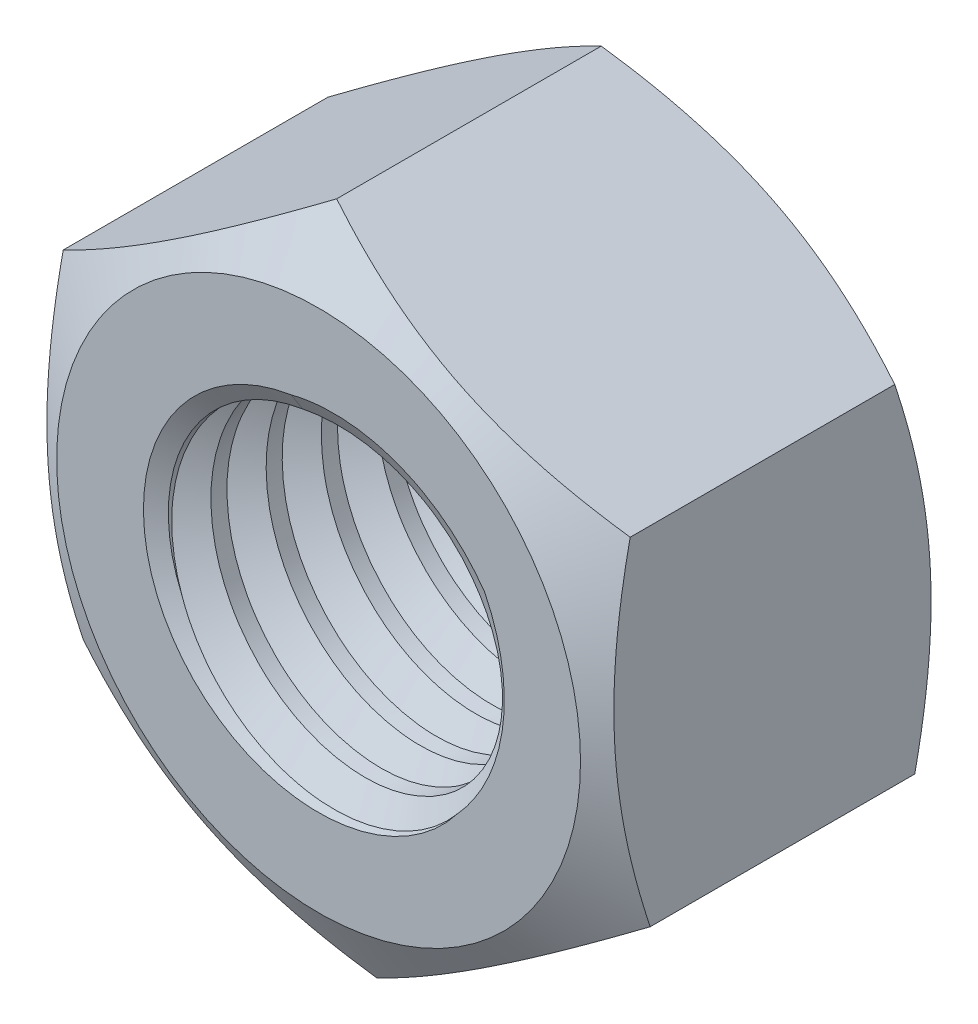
from build123d import *
from OCP.BRepFilletAPI import BRepFilletAPI_MakeChamfer

# Parameters (mm, degrees)
SKETCH1_R               = 5.05
BOSS_EXTRUDE1_DEPTH     = 5.4
SKETCH2_OUTSIDE_W       = 91.108
SKETCH2_OUTSIDE_H       = 93.252
SKETCH2_OUTSIDE_R       = 8.3
CUT_EXTRUDE1_DEPTH      = 18.627815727
CUT_EXTRUDE1_DRAFT      = -60
MIRROR1_COPY_1_SKETCH_W = 91.108
MIRROR1_COPY_1_SKETCH_H = 93.252
MIRROR1_COPY_1_SKETCH_R = 8.3
MIRROR1_COPY_1_DEPTH    = 18.627815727
MIRROR1_COPY_1_DRAFT    = -60
CHAMFER1_SIZE           = 0.5
CHAMFER1_SIZE2          = 0.288675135
CUT_SWEEP1_PITCH        = 1.75
CUT_SWEEP1_HEIGHT       = 13
CUT_SWEEP1_RADIUS       = 5.05
CUT_SWEEP1_START_ANGLE  = 180


with BuildPart() as part:
    # Sketch1 → Boss-Extrude1 (new, symmetric)
    with BuildSketch(Plane.XY):
        Polygon((8.665651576, 5.736417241), (-0.635057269, 10.372883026), (-9.300708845, 4.636465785), (-8.665651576, -5.736417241), (0.635057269, -10.372883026), (9.300708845, -4.636465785), align=None)
        with Locations(Location((0, 0, 0), (0, 0, 180))):
            Circle(SKETCH1_R, mode=Mode.SUBTRACT)
    extrude(amount=BOSS_EXTRUDE1_DEPTH, both=True)


with BuildPart() as cut_extrude1_tool:
    # Sketch2 outside → Cut-Extrude1 (with draft: the straight prism first)
    with BuildSketch(Plane.XY.offset(5.4)):
        Rectangle(SKETCH2_OUTSIDE_W, SKETCH2_OUTSIDE_H)
        Circle(SKETCH2_OUTSIDE_R, mode=Mode.SUBTRACT)
    extrude(amount=-CUT_EXTRUDE1_DEPTH)
    # Cut-Extrude1: the draft: its side faces are tilted about the plane it starts from
    cut_extrude1_sides = [cut_extrude1_tool.faces().sort_by_distance(p)[0] for p in [
        (0, -46.626, -3.913907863),
        (45.554, 0, -3.913907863),
        (0, 46.626, -3.913907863),
        (-45.554, 0, -3.913907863),
        (-8.3, 0, -3.913907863),
    ]]
    draft(cut_extrude1_sides, Plane.XY.offset(5.4), CUT_EXTRUDE1_DRAFT)


with BuildPart() as part_1:
    add(part.part)

    # Cut-Extrude1: cut by cut_extrude1_tool
    add(cut_extrude1_tool.part, mode=Mode.SUBTRACT)


with BuildPart() as mirror1_copy_1_tool:
    # Mirror1 copy 1 sketch → Mirror1 copy 1 (with draft: the straight prism first)
    with BuildSketch(Plane(origin=(0, 0, -5.4), x_dir=(1, 0, 0), z_dir=(0, 0, -1))):
        Rectangle(MIRROR1_COPY_1_SKETCH_W, MIRROR1_COPY_1_SKETCH_H)
        Circle(MIRROR1_COPY_1_SKETCH_R, mode=Mode.SUBTRACT)
    extrude(amount=-MIRROR1_COPY_1_DEPTH)
    # Mirror1 copy 1: the draft: its side faces are tilted about the plane it starts from
    mirror1_copy_1_sides = [mirror1_copy_1_tool.faces().sort_by_distance(p)[0] for p in [
        (0, -46.626, 3.913907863),
        (45.554, 0, 3.913907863),
        (0, 46.626, 3.913907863),
        (-45.554, 0, 3.913907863),
        (-8.3, 0, 3.913907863),
    ]]
    draft(mirror1_copy_1_sides, Plane(origin=(0, 0, -5.4), x_dir=(1, 0, 0), z_dir=(0, 0, -1)), MIRROR1_COPY_1_DRAFT)


with BuildPart() as part_2:
    add(part_1.part)

    # Mirror1 copy 1: cut by mirror1_copy_1_tool
    add(mirror1_copy_1_tool.part, mode=Mode.SUBTRACT)

    # Chamfer1: one chamfer whose edges measure the first distance from different faces: ONE call of the kernel's chamfer builder (chamfer() names one face for all edges)
    chamfer1_edges_1 = [part_2.edges().sort_by_distance(p)[0] for p in [
        (5.05, 0, -5.4),
    ]]
    chamfer1_side_1 = [part_2.faces().sort_by_distance(p)[0] for p in [
        (5.05, 0, 0),
    ]]
    chamfer1_edges_2 = [part_2.edges().sort_by_distance(p)[0] for p in [
        (5.05, 0, 5.4),
    ]]
    chamfer1_side_2 = [part_2.faces().sort_by_distance(p)[0] for p in [
        (-8.065240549, 0, 5.4),
    ]]
    chamfer1 = BRepFilletAPI_MakeChamfer(part_2.part.solid().wrapped)
    for e in chamfer1_edges_1:
        chamfer1.Add(CHAMFER1_SIZE, CHAMFER1_SIZE2, e.wrapped, chamfer1_side_1[0].wrapped)  # the first distance lies on this face
    for e in chamfer1_edges_2:
        chamfer1.Add(CHAMFER1_SIZE, CHAMFER1_SIZE2, e.wrapped, chamfer1_side_2[0].wrapped)  # the first distance lies on this face
    add(Compound.cast(chamfer1.Shape()), mode=Mode.REPLACE)

    # Cut-Sweep1: sweep along a helix
    with BuildLine() as cut_sweep1_path:
        add(Helix(CUT_SWEEP1_PITCH, CUT_SWEEP1_HEIGHT, CUT_SWEEP1_RADIUS, center=(0, 0, 5.4), direction=(0, 0, -1), mode=Mode.PRIVATE).rotate(Axis((0, 0, 5.4), (0, 0, -1)), CUT_SWEEP1_START_ANGLE))
    # Sketch7 → Cut-Sweep1 (sweep, cut)
    with BuildSketch(Plane(origin=(0, 0, 0), x_dir=(1, 0, 0), z_dir=(0, 1, 0))):
        Polygon((6.125, -7), (4.5125, -6.069022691), (4.5125, -7.930977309), align=None)
    sweep(path=cut_sweep1_path.line, is_frenet=True, mode=Mode.SUBTRACT)


solid = part_2.part
